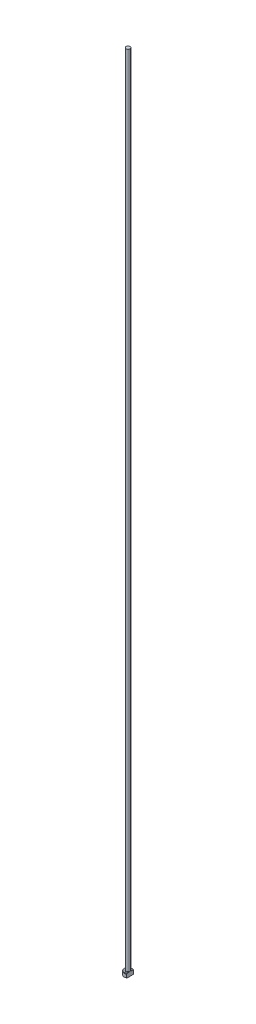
ISO-10303-21;
HEADER;
FILE_DESCRIPTION(('STEP AP214'),'2;1');
FILE_NAME('part.step','',(''),(''),'','','');
FILE_SCHEMA(('AUTOMOTIVE_DESIGN { 1 0 10303 214 1 1 1 1 }'));
ENDSEC;
DATA;
#1=APPLICATION_CONTEXT('core data for automotive mechanical design processes');
#2=APPLICATION_PROTOCOL_DEFINITION('international standard','automotive_design',2000,#1);
#3=PRODUCT_CONTEXT('',#1,'mechanical');
#4=PRODUCT('Part','Part','',(#3));
#5=PRODUCT_RELATED_PRODUCT_CATEGORY('part','',(#4));
#6=PRODUCT_DEFINITION_FORMATION('','',#4);
#7=PRODUCT_DEFINITION_CONTEXT('part definition',#1,'design');
#8=PRODUCT_DEFINITION('design','',#6,#7);
#9=PRODUCT_DEFINITION_SHAPE('','',#8);
#10=(LENGTH_UNIT() NAMED_UNIT(*) SI_UNIT(.MILLI.,.METRE.));
#11=(NAMED_UNIT(*) PLANE_ANGLE_UNIT() SI_UNIT($,.RADIAN.));
#12=(NAMED_UNIT(*) SI_UNIT($,.STERADIAN.) SOLID_ANGLE_UNIT());
#13=UNCERTAINTY_MEASURE_WITH_UNIT(LENGTH_MEASURE(1.E-05),#10,'distance_accuracy_value','');
#14=(GEOMETRIC_REPRESENTATION_CONTEXT(3) GLOBAL_UNCERTAINTY_ASSIGNED_CONTEXT((#13)) GLOBAL_UNIT_ASSIGNED_CONTEXT((#10,
#11,#12)) REPRESENTATION_CONTEXT('',''));
#15=CARTESIAN_POINT('',(0.,0.,0.));
#16=DIRECTION('',(0.,0.,1.));
#17=DIRECTION('',(1.,0.,0.));
#18=AXIS2_PLACEMENT_3D('',#15,#16,#17);
#19=CARTESIAN_POINT('',(0.,0.,0.));
#20=DIRECTION('',(0.,-1.,0.));
#21=DIRECTION('',(0.,0.,-1.));
#22=AXIS2_PLACEMENT_3D('',#19,#20,#21);
#23=PLANE('',#22);
#24=CARTESIAN_POINT('',(0.,0.,0.));
#25=DIRECTION('',(0.,-1.,0.));
#26=DIRECTION('',(0.,0.,-1.));
#27=AXIS2_PLACEMENT_3D('',#24,#25,#26);
#28=CIRCLE('',#27,1.80000000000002);
#29=CARTESIAN_POINT('',(0.999999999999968,0.,1.49666295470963));
#30=VERTEX_POINT('',#29);
#31=CARTESIAN_POINT('',(0.999999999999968,0.,-1.49666295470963));
#32=VERTEX_POINT('',#31);
#33=EDGE_CURVE('E98',#30,#32,#28,.T.);
#34=ORIENTED_EDGE('',*,*,#33,.T.);
#35=DIRECTION('',(0.,0.,1.));
#36=VECTOR('',#35,1.);
#37=CARTESIAN_POINT('',(0.999999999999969,0.,-1.73205080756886));
#38=LINE('',#37,#36);
#39=EDGE_CURVE('E83',#32,#30,#38,.T.);
#40=ORIENTED_EDGE('',*,*,#39,.T.);
#41=EDGE_LOOP('',(#34,#40));
#42=FACE_BOUND('',#41,.T.);
#43=ADVANCED_FACE('F32',(#42),#23,.T.);
#44=CARTESIAN_POINT('',(0.,259.958771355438,0.));
#45=DIRECTION('',(0.,1.,0.));
#46=DIRECTION('',(0.,0.,1.));
#47=AXIS2_PLACEMENT_3D('',#44,#45,#46);
#48=CYLINDRICAL_SURFACE('',#47,1.99999999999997);
#49=CARTESIAN_POINT('',(0.,1.79999999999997,0.));
#50=DIRECTION('',(0.,1.,0.));
#51=DIRECTION('',(0.,0.,1.));
#52=AXIS2_PLACEMENT_3D('',#49,#50,#51);
#53=CIRCLE('',#52,1.99999999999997);
#54=CARTESIAN_POINT('',(0.999999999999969,1.79999999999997,1.73205080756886));
#55=VERTEX_POINT('',#54);
#56=CARTESIAN_POINT('',(0.999999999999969,1.79999999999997,-1.73205080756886));
#57=VERTEX_POINT('',#56);
#58=EDGE_CURVE('E104',#55,#57,#53,.F.);
#59=ORIENTED_EDGE('',*,*,#58,.T.);
#60=DIRECTION('',(0.,-1.,0.));
#61=VECTOR('',#60,1.);
#62=CARTESIAN_POINT('',(0.999999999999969,400.,-1.73205080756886));
#63=LINE('',#62,#61);
#64=CARTESIAN_POINT('',(0.999999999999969,0.199999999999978,-1.73205080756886));
#65=VERTEX_POINT('',#64);
#66=EDGE_CURVE('E183',#57,#65,#63,.T.);
#67=ORIENTED_EDGE('',*,*,#66,.T.);
#68=CARTESIAN_POINT('',(0.,0.199999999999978,0.));
#69=DIRECTION('',(0.,-1.,0.));
#70=DIRECTION('',(0.,0.,-1.));
#71=AXIS2_PLACEMENT_3D('',#68,#69,#70);
#72=CIRCLE('',#71,1.99999999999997);
#73=CARTESIAN_POINT('',(0.999999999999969,0.199999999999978,1.73205080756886));
#74=VERTEX_POINT('',#73);
#75=EDGE_CURVE('E100',#65,#74,#72,.F.);
#76=ORIENTED_EDGE('',*,*,#75,.T.);
#77=DIRECTION('',(0.,-1.,0.));
#78=VECTOR('',#77,1.);
#79=CARTESIAN_POINT('',(0.999999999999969,400.,1.73205080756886));
#80=LINE('',#79,#78);
#81=EDGE_CURVE('E93',#55,#74,#80,.T.);
#82=ORIENTED_EDGE('',*,*,#81,.F.);
#83=EDGE_LOOP('',(#59,#67,#76,#82));
#84=FACE_BOUND('',#83,.T.);
#85=ADVANCED_FACE('F158',(#84),#48,.T.);
#86=CARTESIAN_POINT('',(-1.99999999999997,2.,0.));
#87=DIRECTION('',(0.,1.,0.));
#88=DIRECTION('',(0.,0.,1.));
#89=AXIS2_PLACEMENT_3D('',#86,#87,#88);
#90=PLANE('',#89);
#91=CARTESIAN_POINT('',(0.,2.,0.));
#92=DIRECTION('',(0.,1.,0.));
#93=DIRECTION('',(0.,0.,1.));
#94=AXIS2_PLACEMENT_3D('',#91,#92,#93);
#95=CIRCLE('',#94,1.79999999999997);
#96=CARTESIAN_POINT('',(0.999999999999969,2.,-1.49666295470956));
#97=VERTEX_POINT('',#96);
#98=CARTESIAN_POINT('',(0.999999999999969,2.,1.49666295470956));
#99=VERTEX_POINT('',#98);
#100=EDGE_CURVE('E178',#97,#99,#95,.T.);
#101=ORIENTED_EDGE('',*,*,#100,.T.);
#102=DIRECTION('',(0.,0.,-1.));
#103=VECTOR('',#102,1.);
#104=CARTESIAN_POINT('',(0.999999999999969,2.,0.));
#105=LINE('',#104,#103);
#106=CARTESIAN_POINT('',(0.999999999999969,1.99999999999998,0.66332495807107));
#107=VERTEX_POINT('',#106);
#108=EDGE_CURVE('E57',#99,#107,#105,.T.);
#109=ORIENTED_EDGE('',*,*,#108,.T.);
#110=CARTESIAN_POINT('',(0.,2.,0.));
#111=DIRECTION('',(0.,1.,0.));
#112=DIRECTION('',(0.,0.,1.));
#113=AXIS2_PLACEMENT_3D('',#110,#111,#112);
#114=CIRCLE('',#113,1.19999999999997);
#115=CARTESIAN_POINT('',(0.999999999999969,1.99999999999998,-0.663324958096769));
#116=VERTEX_POINT('',#115);
#117=EDGE_CURVE('E107',#107,#116,#114,.F.);
#118=ORIENTED_EDGE('',*,*,#117,.T.);
#119=EDGE_CURVE('E136',#116,#97,#105,.T.);
#120=ORIENTED_EDGE('',*,*,#119,.T.);
#121=EDGE_LOOP('',(#101,#109,#118,#120));
#122=FACE_BOUND('',#121,.T.);
#123=ADVANCED_FACE('F147',(#122),#90,.T.);
#124=CARTESIAN_POINT('',(0.,2.,0.));
#125=DIRECTION('',(0.,-1.,0.));
#126=DIRECTION('',(0.,0.,-1.));
#127=AXIS2_PLACEMENT_3D('',#124,#125,#126);
#128=CONICAL_SURFACE('',#127,1.79999999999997,0.785398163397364);
#129=ORIENTED_EDGE('',*,*,#58,.F.);
#130=CARTESIAN_POINT('',(0.999999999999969,-0.143084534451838,3.81417299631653));
#131=CARTESIAN_POINT('',(0.999999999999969,-0.0593997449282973,3.72765647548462));
#132=CARTESIAN_POINT('',(0.999999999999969,0.0241940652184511,3.64105173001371));
#133=CARTESIAN_POINT('',(0.999999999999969,0.191148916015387,3.46761616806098));
#134=CARTESIAN_POINT('',(0.999999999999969,0.274509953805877,3.38078534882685));
#135=CARTESIAN_POINT('',(0.999999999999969,0.524249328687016,3.11979400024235));
#136=CARTESIAN_POINT('',(0.999999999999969,0.690198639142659,2.94522254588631));
#137=CARTESIAN_POINT('',(0.999999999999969,1.01697550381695,2.59782670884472));
#138=CARTESIAN_POINT('',(0.999999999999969,1.17783928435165,2.42503661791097));
#139=CARTESIAN_POINT('',(0.999999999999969,1.41669118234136,2.16364984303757));
#140=CARTESIAN_POINT('',(0.999999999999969,1.49589273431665,2.07616357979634));
#141=CARTESIAN_POINT('',(0.999999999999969,1.65313803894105,1.90015721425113));
#142=CARTESIAN_POINT('',(0.999999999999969,1.73118183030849,1.81163714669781));
#143=CARTESIAN_POINT('',(0.999999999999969,1.85567318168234,1.66767927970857));
#144=CARTESIAN_POINT('',(0.999999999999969,1.90265415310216,1.61270332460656));
#145=CARTESIAN_POINT('',(0.999999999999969,1.99577882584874,1.50203557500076));
#146=CARTESIAN_POINT('',(0.999999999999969,2.04192244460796,1.44634371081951));
#147=CARTESIAN_POINT('',(0.999999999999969,2.13356596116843,1.33345480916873));
#148=CARTESIAN_POINT('',(0.999999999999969,2.17905399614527,1.27624810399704));
#149=CARTESIAN_POINT('',(0.999999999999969,2.26844283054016,1.1606097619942));
#150=CARTESIAN_POINT('',(0.999999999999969,2.31234379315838,1.1021782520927));
#151=CARTESIAN_POINT('',(0.999999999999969,2.39853453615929,0.982773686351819));
#152=CARTESIAN_POINT('',(0.999999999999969,2.44078986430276,0.921775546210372));
#153=CARTESIAN_POINT('',(0.999999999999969,2.52187810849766,0.797387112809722));
#154=CARTESIAN_POINT('',(0.999999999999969,2.56070631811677,0.733993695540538));
#155=CARTESIAN_POINT('',(0.999999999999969,2.63248592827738,0.604932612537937));
#156=CARTESIAN_POINT('',(0.999999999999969,2.66550424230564,0.539302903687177));
#157=CARTESIAN_POINT('',(0.999999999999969,2.72301550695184,0.404437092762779));
#158=CARTESIAN_POINT('',(0.999999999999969,2.74753707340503,0.335214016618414));
#159=CARTESIAN_POINT('',(0.999999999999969,2.77407110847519,0.23140094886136));
#160=CARTESIAN_POINT('',(0.999999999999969,2.7811074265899,0.198093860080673));
#161=CARTESIAN_POINT('',(0.999999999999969,2.7920050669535,0.130954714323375));
#162=CARTESIAN_POINT('',(0.999999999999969,2.79586666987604,0.0971227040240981));
#163=CARTESIAN_POINT('',(0.999999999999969,2.80013905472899,0.0293410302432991));
#164=CARTESIAN_POINT('',(0.999999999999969,2.8005604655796,-0.00460794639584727));
#165=CARTESIAN_POINT('',(0.999999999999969,2.79795882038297,-0.0723663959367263));
#166=CARTESIAN_POINT('',(0.999999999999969,2.79493547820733,-0.106175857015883));
#167=CARTESIAN_POINT('',(0.999999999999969,2.78105481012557,-0.206326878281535));
#168=CARTESIAN_POINT('',(0.999999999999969,2.76542146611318,-0.272037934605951));
#169=CARTESIAN_POINT('',(0.999999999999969,2.73477554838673,-0.368312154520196));
#170=CARTESIAN_POINT('',(0.999999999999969,2.7233106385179,-0.400123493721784));
#171=CARTESIAN_POINT('',(0.999999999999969,2.69840546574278,-0.462964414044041));
#172=CARTESIAN_POINT('',(0.999999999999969,2.68496560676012,-0.493994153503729));
#173=CARTESIAN_POINT('',(0.999999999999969,2.64209309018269,-0.586298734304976));
#174=CARTESIAN_POINT('',(0.999999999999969,2.61022871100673,-0.646435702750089));
#175=CARTESIAN_POINT('',(0.999999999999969,2.54228534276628,-0.764304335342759));
#176=CARTESIAN_POINT('',(0.999999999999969,2.50620119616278,-0.822032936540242));
#177=CARTESIAN_POINT('',(0.999999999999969,2.4310708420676,-0.935840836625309));
#178=CARTESIAN_POINT('',(0.999999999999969,2.39201347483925,-0.991912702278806));
#179=CARTESIAN_POINT('',(0.999999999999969,2.31195870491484,-1.1025984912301));
#180=CARTESIAN_POINT('',(0.999999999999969,2.27096226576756,-1.15721311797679));
#181=CARTESIAN_POINT('',(0.999999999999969,2.1870169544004,-1.26606869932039));
#182=CARTESIAN_POINT('',(0.999999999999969,2.14404946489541,-1.32029522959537));
#183=CARTESIAN_POINT('',(0.999999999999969,2.05705050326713,-1.42788988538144));
#184=CARTESIAN_POINT('',(0.999999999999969,2.01301896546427,-1.48125795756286));
#185=CARTESIAN_POINT('',(0.999999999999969,1.87995068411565,-1.64010952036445));
#186=CARTESIAN_POINT('',(0.999999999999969,1.78973357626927,-1.74460261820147));
#187=CARTESIAN_POINT('',(0.999999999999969,1.6229034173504,-1.9342683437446));
#188=CARTESIAN_POINT('',(0.999999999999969,1.54658658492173,-2.01970404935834));
#189=CARTESIAN_POINT('',(0.999999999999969,1.39301250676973,-2.18973019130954));
#190=CARTESIAN_POINT('',(0.999999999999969,1.31575523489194,-2.27432060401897));
#191=CARTESIAN_POINT('',(0.999999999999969,1.08283440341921,-2.52732479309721));
#192=CARTESIAN_POINT('',(0.999999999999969,0.926165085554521,-2.69481086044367));
#193=CARTESIAN_POINT('',(0.999999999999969,0.617772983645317,-3.02147252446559));
#194=CARTESIAN_POINT('',(0.999999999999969,0.466111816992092,-3.18070657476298));
#195=CARTESIAN_POINT('',(0.999999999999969,0.238015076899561,-3.41880818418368));
#196=CARTESIAN_POINT('',(0.999999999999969,0.161924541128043,-3.49800657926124));
#197=CARTESIAN_POINT('',(0.999999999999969,0.00955322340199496,-3.65621892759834));
#198=CARTESIAN_POINT('',(0.999999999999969,-0.0667275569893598,-3.7352328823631));
#199=CARTESIAN_POINT('',(0.999999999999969,-0.143084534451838,-3.81417299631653));
#200=B_SPLINE_CURVE_WITH_KNOTS('',3,(#130,#131,#132,#133,#134,#135,#136,#137,#138,#139,#140,
#141,#142,#143,#144,#145,#146,#147,#148,#149,#150,#151,#152,#153,#154,#155,#156,#157,#158,#159,
#160,#161,#162,#163,#164,#165,#166,#167,#168,#169,#170,#171,#172,#173,#174,#175,#176,#177,#178,
#179,#180,#181,#182,#183,#184,#185,#186,#187,#188,#189,#190,#191,#192,#193,#194,#195,#196,#197,
#198,#199),.UNSPECIFIED.,.F.,.F.,(4,2,2,2,2,2,2,2,2,2,2,2,2,2,2,2,2,2,2,2,2,2,2,2,2,2,2,2,2,2,2,
2,2,2,4),(0.,0.361101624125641,0.722207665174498,1.44478731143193,2.15299784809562,
2.50702638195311,2.86104304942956,3.07798416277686,3.29494655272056,3.51418925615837,
3.73340935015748,3.95594813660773,4.17878792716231,4.39886399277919,4.6181915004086,
4.72018864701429,4.82217677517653,4.92384967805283,5.0255310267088,5.22698459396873,
5.3283885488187,5.42977179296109,5.6336520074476,5.83778406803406,6.04272417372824,
6.24756349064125,6.45510395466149,6.66265726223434,7.07676259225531,7.42043039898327,
7.76410778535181,8.45210822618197,9.11180822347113,9.44129145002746,9.77077197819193),.UNSPECIFIED.);
#201=EDGE_CURVE('E135',#55,#99,#200,.T.);
#202=ORIENTED_EDGE('',*,*,#201,.T.);
#203=ORIENTED_EDGE('',*,*,#100,.F.);
#204=EDGE_CURVE('E127',#97,#57,#200,.T.);
#205=ORIENTED_EDGE('',*,*,#204,.T.);
#206=EDGE_LOOP('',(#129,#202,#203,#205));
#207=FACE_BOUND('',#206,.T.);
#208=ADVANCED_FACE('F143',(#207),#128,.T.);
#209=CARTESIAN_POINT('',(0.,0.199999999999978,0.));
#210=DIRECTION('',(0.,1.,0.));
#211=DIRECTION('',(0.,0.,1.));
#212=AXIS2_PLACEMENT_3D('',#209,#210,#211);
#213=CONICAL_SURFACE('',#212,1.99999999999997,0.785398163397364);
#214=ORIENTED_EDGE('',*,*,#75,.F.);
#215=CARTESIAN_POINT('',(0.999999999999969,2.14308453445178,-3.81417299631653));
#216=CARTESIAN_POINT('',(0.999999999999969,2.05939974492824,-3.72765647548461));
#217=CARTESIAN_POINT('',(0.999999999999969,1.97580593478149,-3.64105173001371));
#218=CARTESIAN_POINT('',(0.999999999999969,1.80885108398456,-3.46761616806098));
#219=CARTESIAN_POINT('',(0.999999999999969,1.72549004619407,-3.38078534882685));
#220=CARTESIAN_POINT('',(0.999999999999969,1.47575067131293,-3.11979400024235));
#221=CARTESIAN_POINT('',(0.999999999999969,1.30980136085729,-2.94522254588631));
#222=CARTESIAN_POINT('',(0.999999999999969,0.983024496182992,-2.59782670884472));
#223=CARTESIAN_POINT('',(0.999999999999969,0.822160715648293,-2.42503661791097));
#224=CARTESIAN_POINT('',(0.999999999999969,0.583308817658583,-2.16364984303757));
#225=CARTESIAN_POINT('',(0.999999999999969,0.504107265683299,-2.07616357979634));
#226=CARTESIAN_POINT('',(0.999999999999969,0.346861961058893,-1.90015721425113));
#227=CARTESIAN_POINT('',(0.999999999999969,0.26881816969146,-1.81163714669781));
#228=CARTESIAN_POINT('',(0.999999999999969,0.144326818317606,-1.66767927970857));
#229=CARTESIAN_POINT('',(0.999999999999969,0.0973458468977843,-1.61270332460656));
#230=CARTESIAN_POINT('',(0.999999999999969,0.00422117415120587,-1.50203557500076));
#231=CARTESIAN_POINT('',(0.999999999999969,-0.0419224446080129,-1.44634371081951));
#232=CARTESIAN_POINT('',(0.999999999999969,-0.133565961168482,-1.33345480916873));
#233=CARTESIAN_POINT('',(0.999999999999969,-0.179053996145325,-1.27624810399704));
#234=CARTESIAN_POINT('',(0.999999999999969,-0.268442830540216,-1.1606097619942));
#235=CARTESIAN_POINT('',(0.999999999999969,-0.312343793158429,-1.1021782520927));
#236=CARTESIAN_POINT('',(0.999999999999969,-0.398534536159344,-0.982773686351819));
#237=CARTESIAN_POINT('',(0.999999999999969,-0.440789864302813,-0.921775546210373));
#238=CARTESIAN_POINT('',(0.999999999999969,-0.52187810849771,-0.797387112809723));
#239=CARTESIAN_POINT('',(0.999999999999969,-0.560706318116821,-0.733993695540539));
#240=CARTESIAN_POINT('',(0.999999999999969,-0.632485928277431,-0.604932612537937));
#241=CARTESIAN_POINT('',(0.999999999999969,-0.665504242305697,-0.539302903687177));
#242=CARTESIAN_POINT('',(0.999999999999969,-0.723015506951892,-0.404437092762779));
#243=CARTESIAN_POINT('',(0.999999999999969,-0.747537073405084,-0.335214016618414));
#244=CARTESIAN_POINT('',(0.999999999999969,-0.774071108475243,-0.23140094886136));
#245=CARTESIAN_POINT('',(0.999999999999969,-0.781107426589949,-0.198093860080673));
#246=CARTESIAN_POINT('',(0.999999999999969,-0.792005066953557,-0.130954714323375));
#247=CARTESIAN_POINT('',(0.999999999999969,-0.795866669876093,-0.0971227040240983));
#248=CARTESIAN_POINT('',(0.999999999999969,-0.80013905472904,-0.0293410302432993));
#249=CARTESIAN_POINT('',(0.999999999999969,-0.800560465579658,0.00460794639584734));
#250=CARTESIAN_POINT('',(0.999999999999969,-0.797958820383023,0.0723663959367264));
#251=CARTESIAN_POINT('',(0.999999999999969,-0.794935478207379,0.106175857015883));
#252=CARTESIAN_POINT('',(0.999999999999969,-0.781054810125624,0.206326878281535));
#253=CARTESIAN_POINT('',(0.999999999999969,-0.765421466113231,0.272037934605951));
#254=CARTESIAN_POINT('',(0.999999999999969,-0.734775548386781,0.368312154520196));
#255=CARTESIAN_POINT('',(0.999999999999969,-0.723310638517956,0.400123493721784));
#256=CARTESIAN_POINT('',(0.999999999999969,-0.698405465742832,0.462964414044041));
#257=CARTESIAN_POINT('',(0.999999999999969,-0.684965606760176,0.493994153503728));
#258=CARTESIAN_POINT('',(0.999999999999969,-0.64209309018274,0.586298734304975));
#259=CARTESIAN_POINT('',(0.999999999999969,-0.610228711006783,0.646435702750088));
#260=CARTESIAN_POINT('',(0.999999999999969,-0.542285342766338,0.764304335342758));
#261=CARTESIAN_POINT('',(0.999999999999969,-0.506201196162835,0.822032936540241));
#262=CARTESIAN_POINT('',(0.999999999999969,-0.431070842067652,0.935840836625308));
#263=CARTESIAN_POINT('',(0.999999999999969,-0.3920134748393,0.991912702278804));
#264=CARTESIAN_POINT('',(0.999999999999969,-0.311958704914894,1.1025984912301));
#265=CARTESIAN_POINT('',(0.999999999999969,-0.270962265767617,1.15721311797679));
#266=CARTESIAN_POINT('',(0.999999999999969,-0.187016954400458,1.26606869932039));
#267=CARTESIAN_POINT('',(0.999999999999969,-0.144049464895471,1.32029522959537));
#268=CARTESIAN_POINT('',(0.999999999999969,-0.0570505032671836,1.42788988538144));
#269=CARTESIAN_POINT('',(0.999999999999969,-0.0130189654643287,1.48125795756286));
#270=CARTESIAN_POINT('',(0.999999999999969,0.12004931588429,1.64010952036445));
#271=CARTESIAN_POINT('',(0.999999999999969,0.210266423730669,1.74460261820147));
#272=CARTESIAN_POINT('',(0.999999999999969,0.377096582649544,1.93426834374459));
#273=CARTESIAN_POINT('',(0.999999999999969,0.453413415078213,2.01970404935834));
#274=CARTESIAN_POINT('',(0.999999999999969,0.606987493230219,2.18973019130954));
#275=CARTESIAN_POINT('',(0.999999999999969,0.684244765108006,2.27432060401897));
#276=CARTESIAN_POINT('',(0.999999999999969,0.917165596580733,2.52732479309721));
#277=CARTESIAN_POINT('',(0.999999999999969,1.07383491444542,2.69481086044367));
#278=CARTESIAN_POINT('',(0.999999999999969,1.38222701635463,3.02147252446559));
#279=CARTESIAN_POINT('',(0.999999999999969,1.53388818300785,3.18070657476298));
#280=CARTESIAN_POINT('',(0.999999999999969,1.76198492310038,3.41880818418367));
#281=CARTESIAN_POINT('',(0.999999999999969,1.8380754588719,3.49800657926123));
#282=CARTESIAN_POINT('',(0.999999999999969,1.99044677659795,3.65621892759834));
#283=CARTESIAN_POINT('',(0.999999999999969,2.0667275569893,3.7352328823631));
#284=CARTESIAN_POINT('',(0.999999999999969,2.14308453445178,3.81417299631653));
#285=B_SPLINE_CURVE_WITH_KNOTS('',3,(#215,#216,#217,#218,#219,#220,#221,#222,#223,#224,#225,
#226,#227,#228,#229,#230,#231,#232,#233,#234,#235,#236,#237,#238,#239,#240,#241,#242,#243,#244,
#245,#246,#247,#248,#249,#250,#251,#252,#253,#254,#255,#256,#257,#258,#259,#260,#261,#262,#263,
#264,#265,#266,#267,#268,#269,#270,#271,#272,#273,#274,#275,#276,#277,#278,#279,#280,#281,#282,
#283,#284),.UNSPECIFIED.,.F.,.F.,(4,2,2,2,2,2,2,2,2,2,2,2,2,2,2,2,2,2,2,2,2,2,2,2,2,2,2,2,2,2,2,
2,2,2,4),(0.,0.361101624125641,0.722207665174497,1.44478731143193,2.15299784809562,
2.50702638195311,2.86104304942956,3.07798416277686,3.29494655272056,3.51418925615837,
3.73340935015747,3.95594813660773,4.17878792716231,4.39886399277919,4.6181915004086,
4.72018864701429,4.82217677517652,4.92384967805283,5.0255310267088,5.22698459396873,
5.3283885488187,5.42977179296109,5.6336520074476,5.83778406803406,6.04272417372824,
6.24756349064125,6.45510395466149,6.66265726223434,7.07676259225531,7.42043039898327,
7.7641077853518,8.45210822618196,9.11180822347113,9.44129145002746,9.77077197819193),.UNSPECIFIED.);
#286=EDGE_CURVE('E86',#65,#32,#285,.T.);
#287=ORIENTED_EDGE('',*,*,#286,.T.);
#288=ORIENTED_EDGE('',*,*,#33,.F.);
#289=EDGE_CURVE('E89',#30,#74,#285,.T.);
#290=ORIENTED_EDGE('',*,*,#289,.T.);
#291=EDGE_LOOP('',(#214,#287,#288,#290));
#292=FACE_BOUND('',#291,.T.);
#293=ADVANCED_FACE('F97',(#292),#213,.T.);
#294=CARTESIAN_POINT('',(0.,2.19999999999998,0.));
#295=DIRECTION('',(0.,1.,0.));
#296=DIRECTION('',(0.,0.,1.));
#297=AXIS2_PLACEMENT_3D('',#294,#295,#296);
#298=TOROIDAL_SURFACE('',#297,1.19999999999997,0.2);
#299=CARTESIAN_POINT('',(0.999999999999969,2.19999999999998,0.));
#300=CARTESIAN_POINT('',(0.999999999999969,2.20000051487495,2.59081815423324E-12));
#301=CARTESIAN_POINT('',(0.999999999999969,2.20000102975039,-9.42496323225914E-08));
#302=CARTESIAN_POINT('',(0.999999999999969,2.20000202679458,-4.00799840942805E-07));
#303=CARTESIAN_POINT('',(0.999999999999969,2.20000250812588,-6.15372267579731E-07));
#304=CARTESIAN_POINT('',(0.999999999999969,2.20000346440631,-1.13351400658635E-06));
#305=CARTESIAN_POINT('',(0.999999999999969,2.20000393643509,-1.44235223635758E-06));
#306=CARTESIAN_POINT('',(0.999999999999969,2.20000483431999,-2.11388874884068E-06));
#307=CARTESIAN_POINT('',(0.999999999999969,2.20000526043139,-2.47625950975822E-06));
#308=CARTESIAN_POINT('',(0.999999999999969,2.20000666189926,-3.75794155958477E-06));
#309=CARTESIAN_POINT('',(0.999999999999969,2.20000757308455,-4.74818954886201E-06));
#310=CARTESIAN_POINT('',(0.999999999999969,2.2000092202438,-6.81289830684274E-06));
#311=CARTESIAN_POINT('',(0.999999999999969,2.20000996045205,-7.88417644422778E-06));
#312=CARTESIAN_POINT('',(0.999999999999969,2.20001267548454,-1.19907293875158E-05));
#313=CARTESIAN_POINT('',(0.999999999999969,2.20001450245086,-1.51274184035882E-05));
#314=CARTESIAN_POINT('',(0.999999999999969,2.20001755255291,-2.13715425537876E-05));
#315=CARTESIAN_POINT('',(0.999999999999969,2.20001881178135,-2.44620176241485E-05));
#316=CARTESIAN_POINT('',(0.999999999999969,2.20002404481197,-3.74145208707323E-05));
#317=CARTESIAN_POINT('',(0.999999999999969,2.20002793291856,-4.73052124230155E-05));
#318=CARTESIAN_POINT('',(0.999999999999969,2.20003428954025,-6.59457074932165E-05));
#319=CARTESIAN_POINT('',(0.999999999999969,2.20003688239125,-7.46515299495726E-05));
#320=CARTESIAN_POINT('',(0.999999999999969,2.20005709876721,-0.000137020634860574));
#321=CARTESIAN_POINT('',(0.999999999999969,2.20008244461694,-0.000187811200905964));
#322=CARTESIAN_POINT('',(0.999999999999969,2.2001767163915,-0.00038404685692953));
#323=CARTESIAN_POINT('',(0.999999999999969,2.20023990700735,-0.000531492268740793));
#324=CARTESIAN_POINT('',(0.999999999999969,2.20048701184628,-0.00109942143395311));
#325=CARTESIAN_POINT('',(0.999999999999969,2.20067693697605,-0.00151784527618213));
#326=CARTESIAN_POINT('',(0.999999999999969,2.20144296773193,-0.00321386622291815));
#327=CARTESIAN_POINT('',(0.999999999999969,2.20201230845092,-0.00449374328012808));
#328=CARTESIAN_POINT('',(0.999999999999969,2.20998444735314,-0.0224047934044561));
#329=CARTESIAN_POINT('',(0.999999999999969,2.21743524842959,-0.0390202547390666));
#330=CARTESIAN_POINT('',(0.999999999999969,2.23197002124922,-0.0717084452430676));
#331=CARTESIAN_POINT('',(0.999999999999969,2.23905766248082,-0.0877796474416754));
#332=CARTESIAN_POINT('',(0.999999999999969,2.25389009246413,-0.121781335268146));
#333=CARTESIAN_POINT('',(0.999999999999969,2.26161964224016,-0.139718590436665));
#334=CARTESIAN_POINT('',(0.999999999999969,2.27689168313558,-0.175878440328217));
#335=CARTESIAN_POINT('',(0.999999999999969,2.28443162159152,-0.194102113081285));
#336=CARTESIAN_POINT('',(0.999999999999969,2.30282726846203,-0.239840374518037));
#337=CARTESIAN_POINT('',(0.999999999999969,2.31345710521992,-0.267447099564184));
#338=CARTESIAN_POINT('',(0.999999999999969,2.33331094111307,-0.322481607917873));
#339=CARTESIAN_POINT('',(0.999999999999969,2.34256072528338,-0.349899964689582));
#340=CARTESIAN_POINT('',(0.999999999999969,2.35732089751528,-0.398044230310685));
#341=CARTESIAN_POINT('',(0.999999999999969,2.36317895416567,-0.41866173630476));
#342=CARTESIAN_POINT('',(0.999999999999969,2.37387907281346,-0.460275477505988));
#343=CARTESIAN_POINT('',(0.999999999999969,2.37871519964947,-0.481273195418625));
#344=CARTESIAN_POINT('',(0.999999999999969,2.39174175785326,-0.546853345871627));
#345=CARTESIAN_POINT('',(0.999999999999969,2.39776253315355,-0.591947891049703));
#346=CARTESIAN_POINT('',(0.999999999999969,2.40040174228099,-0.660990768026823));
#347=CARTESIAN_POINT('',(0.999999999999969,2.400126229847,-0.684818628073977));
#348=CARTESIAN_POINT('',(0.999999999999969,2.39660783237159,-0.732027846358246));
#349=CARTESIAN_POINT('',(0.999999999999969,2.39339826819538,-0.755411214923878));
#350=CARTESIAN_POINT('',(0.999999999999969,2.38447874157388,-0.796083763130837));
#351=CARTESIAN_POINT('',(0.999999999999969,2.37951676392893,-0.813533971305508));
#352=CARTESIAN_POINT('',(0.999999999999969,2.36698902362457,-0.847531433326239));
#353=CARTESIAN_POINT('',(0.999999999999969,2.35942232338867,-0.864078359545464));
#354=CARTESIAN_POINT('',(0.999999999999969,2.34431787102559,-0.890141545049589));
#355=CARTESIAN_POINT('',(0.999999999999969,2.33762931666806,-0.900148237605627));
#356=CARTESIAN_POINT('',(0.999999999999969,2.32281345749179,-0.9190336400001));
#357=CARTESIAN_POINT('',(0.999999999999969,2.3146887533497,-0.927914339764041));
#358=CARTESIAN_POINT('',(0.999999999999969,2.29878569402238,-0.942427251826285));
#359=CARTESIAN_POINT('',(0.999999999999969,2.29127620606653,-0.948352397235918));
#360=CARTESIAN_POINT('',(0.999999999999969,2.27538509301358,-0.958904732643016));
#361=CARTESIAN_POINT('',(0.999999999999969,2.26700378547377,-0.963532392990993));
#362=CARTESIAN_POINT('',(0.999999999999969,2.24944905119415,-0.971220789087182));
#363=CARTESIAN_POINT('',(0.999999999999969,2.24026913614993,-0.974266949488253));
#364=CARTESIAN_POINT('',(0.999999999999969,2.22148612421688,-0.978466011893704));
#365=CARTESIAN_POINT('',(0.999999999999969,2.21188346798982,-0.979620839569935));
#366=CARTESIAN_POINT('',(0.999999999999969,2.19406751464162,-0.979911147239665));
#367=CARTESIAN_POINT('',(0.999999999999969,2.18585759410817,-0.979318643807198));
#368=CARTESIAN_POINT('',(0.999999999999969,2.16966497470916,-0.976727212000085));
#369=CARTESIAN_POINT('',(0.999999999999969,2.16168225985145,-0.974728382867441));
#370=CARTESIAN_POINT('',(0.999999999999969,2.14632905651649,-0.969513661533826));
#371=CARTESIAN_POINT('',(0.999999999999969,2.13894889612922,-0.966325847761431));
#372=CARTESIAN_POINT('',(0.999999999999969,2.12474145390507,-0.958901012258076));
#373=CARTESIAN_POINT('',(0.999999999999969,2.11791436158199,-0.954663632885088));
#374=CARTESIAN_POINT('',(0.999999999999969,2.10210888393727,-0.94332347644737));
#375=CARTESIAN_POINT('',(0.999999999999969,2.09345388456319,-0.935769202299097));
#376=CARTESIAN_POINT('',(0.999999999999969,2.07747441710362,-0.919359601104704));
#377=CARTESIAN_POINT('',(0.999999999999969,2.07015330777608,-0.910501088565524));
#378=CARTESIAN_POINT('',(0.999999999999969,2.05394486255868,-0.887884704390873));
#379=CARTESIAN_POINT('',(0.999999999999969,2.04572469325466,-0.873650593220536));
#380=CARTESIAN_POINT('',(0.999999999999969,2.03162462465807,-0.844119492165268));
#381=CARTESIAN_POINT('',(0.999999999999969,2.02574383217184,-0.828822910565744));
#382=CARTESIAN_POINT('',(0.999999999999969,2.01314628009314,-0.788605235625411));
#383=CARTESIAN_POINT('',(0.999999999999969,2.00790637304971,-0.763225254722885));
#384=CARTESIAN_POINT('',(0.999999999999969,2.00123778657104,-0.711706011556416));
#385=CARTESIAN_POINT('',(0.999999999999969,1.99986086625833,-0.685561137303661));
#386=CARTESIAN_POINT('',(0.999999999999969,2.00029138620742,-0.610897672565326));
#387=CARTESIAN_POINT('',(0.999999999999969,2.00583944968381,-0.56240829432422));
#388=CARTESIAN_POINT('',(0.999999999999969,2.01894675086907,-0.492015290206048));
#389=CARTESIAN_POINT('',(0.999999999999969,2.02392178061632,-0.469516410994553));
#390=CARTESIAN_POINT('',(0.999999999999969,2.03507986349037,-0.424950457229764));
#391=CARTESIAN_POINT('',(0.999999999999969,2.04125559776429,-0.402881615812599));
#392=CARTESIAN_POINT('',(0.999999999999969,2.05640318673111,-0.35306390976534));
#393=CARTESIAN_POINT('',(0.999999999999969,2.06567810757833,-0.325409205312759));
#394=CARTESIAN_POINT('',(0.999999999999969,2.08561584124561,-0.26990072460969));
#395=CARTESIAN_POINT('',(0.999999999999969,2.09630536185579,-0.242056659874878));
#396=CARTESIAN_POINT('',(0.999999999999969,2.11482832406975,-0.195905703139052));
#397=CARTESIAN_POINT('',(0.999999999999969,2.12243033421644,-0.177504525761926));
#398=CARTESIAN_POINT('',(0.999999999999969,2.13783353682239,-0.140994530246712));
#399=CARTESIAN_POINT('',(0.999999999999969,2.14563210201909,-0.122884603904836));
#400=CARTESIAN_POINT('',(0.999999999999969,2.16059970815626,-0.0885577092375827));
#401=CARTESIAN_POINT('',(0.999999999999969,2.1677530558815,-0.0723337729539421));
#402=CARTESIAN_POINT('',(0.999999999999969,2.18242403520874,-0.0393353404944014));
#403=CARTESIAN_POINT('',(0.999999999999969,2.18994542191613,-0.0225624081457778));
#404=CARTESIAN_POINT('',(0.999999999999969,2.19798770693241,-0.00449370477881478));
#405=CARTESIAN_POINT('',(0.999999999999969,2.1985570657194,-0.00321379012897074));
#406=CARTESIAN_POINT('',(0.999999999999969,2.19932310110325,-0.00151776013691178));
#407=CARTESIAN_POINT('',(0.999999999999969,2.19951301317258,-0.00109936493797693));
#408=CARTESIAN_POINT('',(0.999999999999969,2.19976010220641,-0.000531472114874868));
#409=CARTESIAN_POINT('',(0.999999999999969,2.19982328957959,-0.000384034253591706));
#410=CARTESIAN_POINT('',(0.999999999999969,2.19991755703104,-0.000187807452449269));
#411=CARTESIAN_POINT('',(0.999999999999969,2.1999429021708,-0.000137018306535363));
#412=CARTESIAN_POINT('',(0.999999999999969,2.19996311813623,-7.46508462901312E-05));
#413=CARTESIAN_POINT('',(0.999999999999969,2.19996571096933,-6.59451379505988E-05));
#414=CARTESIAN_POINT('',(0.999999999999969,2.19997206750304,-4.73048898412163E-05));
#415=CARTESIAN_POINT('',(0.999999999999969,2.19997595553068,-3.74143280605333E-05));
#416=CARTESIAN_POINT('',(0.999999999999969,2.19998118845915,-2.44619706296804E-05));
#417=CARTESIAN_POINT('',(0.999999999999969,2.19998244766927,-2.1371514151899E-05));
#418=CARTESIAN_POINT('',(0.999999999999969,2.19998549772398,-1.5127424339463E-05));
#419=CARTESIAN_POINT('',(0.999999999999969,2.19998732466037,-1.19907504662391E-05));
#420=CARTESIAN_POINT('',(0.999999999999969,2.19999003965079,-7.88421136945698E-06));
#421=CARTESIAN_POINT('',(0.999999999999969,2.19999077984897,-6.81293469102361E-06));
#422=CARTESIAN_POINT('',(0.999999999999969,2.19999242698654,-4.74822681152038E-06));
#423=CARTESIAN_POINT('',(0.999999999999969,2.19999333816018,-3.75797816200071E-06));
#424=CARTESIAN_POINT('',(0.999999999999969,2.1999947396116,-2.47629275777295E-06));
#425=CARTESIAN_POINT('',(0.999999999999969,2.19999516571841,-2.1139205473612E-06));
#426=CARTESIAN_POINT('',(0.999999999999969,2.19999606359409,-1.44238031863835E-06));
#427=CARTESIAN_POINT('',(0.999999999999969,2.19999653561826,-1.13353981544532E-06));
#428=CARTESIAN_POINT('',(0.999999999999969,2.19999749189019,-6.15392568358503E-07));
#429=CARTESIAN_POINT('',(0.999999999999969,2.1999979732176,-4.00816998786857E-07));
#430=CARTESIAN_POINT('',(0.999999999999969,2.19999897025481,-9.42592106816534E-08));
#431=CARTESIAN_POINT('',(0.999999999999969,2.19999948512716,-2.59080736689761E-12));
#432=CARTESIAN_POINT('',(0.999999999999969,2.19999999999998,0.));
#433=B_SPLINE_CURVE_WITH_KNOTS('',3,(#299,#300,#301,#302,#303,#304,#305,#306,#307,#308,#309,
#310,#311,#312,#313,#314,#315,#316,#317,#318,#319,#320,#321,#322,#323,#324,#325,#326,#327,#328,
#329,#330,#331,#332,#333,#334,#335,#336,#337,#338,#339,#340,#341,#342,#343,#344,#345,#346,#347,
#348,#349,#350,#351,#352,#353,#354,#355,#356,#357,#358,#359,#360,#361,#362,#363,#364,#365,#366,
#367,#368,#369,#370,#371,#372,#373,#374,#375,#376,#377,#378,#379,#380,#381,#382,#383,#384,#385,
#386,#387,#388,#389,#390,#391,#392,#393,#394,#395,#396,#397,#398,#399,#400,#401,#402,#403,#404,
#405,#406,#407,#408,#409,#410,#411,#412,#413,#414,#415,#416,#417,#418,#419,#420,#421,#422,#423,
#424,#425,#426,#427,#428,#429,#430,#431,#432),.UNSPECIFIED.,.T.,.F.,(4,2,2,2,2,2,2,2,2,2,2,2,2,
2,2,2,2,2,2,2,2,2,2,2,2,2,2,2,2,2,2,2,2,2,2,2,2,2,2,2,2,2,2,2,2,2,2,2,2,2,2,2,2,2,2,2,2,2,2,2,2,
2,2,2,2,2,4),(0.,1.54318097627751E-06,3.11656716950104E-06,4.80252031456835E-06,
6.47855575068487E-06,1.04956563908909E-05,1.43988918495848E-05,2.52504396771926E-05,
3.52518428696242E-05,6.71249461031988E-05,9.43496753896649E-05,0.000263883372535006,
0.000745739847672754,0.00212351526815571,0.00632669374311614,0.0609485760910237,
0.113643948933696,0.172237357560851,0.231401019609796,0.320129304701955,0.406905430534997,
0.471177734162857,0.53581363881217,0.671617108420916,0.742973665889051,0.813529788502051,
0.867802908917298,0.922095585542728,0.958095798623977,0.994031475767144,1.02261929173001,
1.05119673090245,1.08003306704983,1.10884002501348,1.13341017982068,1.15797860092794,
1.18200020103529,1.20602999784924,1.24030227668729,1.27465969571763,1.32369575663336,
1.37271307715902,1.45002425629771,1.52836647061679,1.67385288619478,1.74297459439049,
1.81168748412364,1.89915940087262,1.9886152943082,2.04834216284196,2.10749314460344,
2.16068730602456,2.21582681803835,2.2200301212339,2.22140780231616,2.2218896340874,
2.22205916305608,2.22208638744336,2.22211826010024,2.22212826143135,2.22213911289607,
2.2221430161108,2.22214703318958,2.22214870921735,2.22215039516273,2.22215196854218,
2.22215351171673),.UNSPECIFIED.);
#434=CARTESIAN_POINT('',(0.999999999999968,2.19999999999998,0.));
#435=VERTEX_POINT('',#434);
#436=EDGE_CURVE('E11',#116,#435,#433,.T.);
#437=ORIENTED_EDGE('',*,*,#436,.F.);
#438=ORIENTED_EDGE('',*,*,#117,.F.);
#439=CARTESIAN_POINT('',(0.999999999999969,2.19999999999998,0.));
#440=CARTESIAN_POINT('',(0.999999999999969,2.19999948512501,-2.59088640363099E-12));
#441=CARTESIAN_POINT('',(0.999999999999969,2.19999897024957,9.42496322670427E-08));
#442=CARTESIAN_POINT('',(0.999999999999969,2.19999797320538,4.00799840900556E-07));
#443=CARTESIAN_POINT('',(0.999999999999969,2.19999749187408,6.15372267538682E-07));
#444=CARTESIAN_POINT('',(0.999999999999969,2.19999653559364,1.13351400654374E-06));
#445=CARTESIAN_POINT('',(0.999999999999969,2.19999606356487,1.44235223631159E-06));
#446=CARTESIAN_POINT('',(0.999999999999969,2.19999516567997,2.11388874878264E-06));
#447=CARTESIAN_POINT('',(0.999999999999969,2.19999473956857,2.47625950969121E-06));
#448=CARTESIAN_POINT('',(0.999999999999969,2.1999933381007,3.75794155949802E-06));
#449=CARTESIAN_POINT('',(0.999999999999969,2.19999242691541,4.74818954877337E-06));
#450=CARTESIAN_POINT('',(0.999999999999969,2.19999077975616,6.8128983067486E-06));
#451=CARTESIAN_POINT('',(0.999999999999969,2.19999003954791,7.88417644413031E-06));
#452=CARTESIAN_POINT('',(0.999999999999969,2.19998732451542,1.19907293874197E-05));
#453=CARTESIAN_POINT('',(0.999999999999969,2.1999854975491,1.51274184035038E-05));
#454=CARTESIAN_POINT('',(0.999999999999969,2.19998244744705,2.13715425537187E-05));
#455=CARTESIAN_POINT('',(0.999999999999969,2.19998118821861,2.44620176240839E-05));
#456=CARTESIAN_POINT('',(0.999999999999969,2.19997595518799,3.74145208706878E-05));
#457=CARTESIAN_POINT('',(0.999999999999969,2.1999720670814,4.73052124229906E-05));
#458=CARTESIAN_POINT('',(0.999999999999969,2.19996571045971,6.59457074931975E-05));
#459=CARTESIAN_POINT('',(0.999999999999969,2.19996311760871,7.46515299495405E-05));
#460=CARTESIAN_POINT('',(0.999999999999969,2.19994290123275,0.000137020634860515));
#461=CARTESIAN_POINT('',(0.999999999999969,2.19991755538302,0.000187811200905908));
#462=CARTESIAN_POINT('',(0.999999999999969,2.19982328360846,0.000384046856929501));
#463=CARTESIAN_POINT('',(0.999999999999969,2.19976009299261,0.000531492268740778));
#464=CARTESIAN_POINT('',(0.999999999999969,2.19951298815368,0.0010994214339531));
#465=CARTESIAN_POINT('',(0.999999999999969,2.19932306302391,0.00151784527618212));
#466=CARTESIAN_POINT('',(0.999999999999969,2.19855703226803,0.00321386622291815));
#467=CARTESIAN_POINT('',(0.999999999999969,2.19798769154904,0.00449374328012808));
#468=CARTESIAN_POINT('',(0.999999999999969,2.19001555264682,0.0224047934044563));
#469=CARTESIAN_POINT('',(0.999999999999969,2.18256475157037,0.0390202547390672));
#470=CARTESIAN_POINT('',(0.999999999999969,2.16802997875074,0.0717084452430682));
#471=CARTESIAN_POINT('',(0.999999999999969,2.16094233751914,0.0877796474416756));
#472=CARTESIAN_POINT('',(0.999999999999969,2.14610990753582,0.121781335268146));
#473=CARTESIAN_POINT('',(0.999999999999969,2.1383803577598,0.139718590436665));
#474=CARTESIAN_POINT('',(0.999999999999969,2.12310831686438,0.175878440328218));
#475=CARTESIAN_POINT('',(0.999999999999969,2.11556837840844,0.194102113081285));
#476=CARTESIAN_POINT('',(0.999999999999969,2.09717273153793,0.239840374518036));
#477=CARTESIAN_POINT('',(0.999999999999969,2.08654289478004,0.267447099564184));
#478=CARTESIAN_POINT('',(0.999999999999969,2.06668905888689,0.322481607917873));
#479=CARTESIAN_POINT('',(0.999999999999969,2.05743927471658,0.349899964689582));
#480=CARTESIAN_POINT('',(0.999999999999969,2.04267910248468,0.398044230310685));
#481=CARTESIAN_POINT('',(0.999999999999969,2.03682104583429,0.41866173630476));
#482=CARTESIAN_POINT('',(0.999999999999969,2.0261209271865,0.460275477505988));
#483=CARTESIAN_POINT('',(0.999999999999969,2.02128480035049,0.481273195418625));
#484=CARTESIAN_POINT('',(0.999999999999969,2.0082582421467,0.546853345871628));
#485=CARTESIAN_POINT('',(0.999999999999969,2.00223746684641,0.591947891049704));
#486=CARTESIAN_POINT('',(0.999999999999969,1.99959825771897,0.660990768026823));
#487=CARTESIAN_POINT('',(0.999999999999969,1.99987377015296,0.684818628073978));
#488=CARTESIAN_POINT('',(0.999999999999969,2.00339216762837,0.732027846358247));
#489=CARTESIAN_POINT('',(0.999999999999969,2.00660173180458,0.755411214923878));
#490=CARTESIAN_POINT('',(0.999999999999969,2.01552125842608,0.796083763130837));
#491=CARTESIAN_POINT('',(0.999999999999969,2.02048323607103,0.813533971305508));
#492=CARTESIAN_POINT('',(0.999999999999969,2.03301097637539,0.847531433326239));
#493=CARTESIAN_POINT('',(0.999999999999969,2.04057767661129,0.864078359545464));
#494=CARTESIAN_POINT('',(0.999999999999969,2.05568212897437,0.89014154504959));
#495=CARTESIAN_POINT('',(0.999999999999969,2.0623706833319,0.900148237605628));
#496=CARTESIAN_POINT('',(0.999999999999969,2.07718654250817,0.9190336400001));
#497=CARTESIAN_POINT('',(0.999999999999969,2.08531124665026,0.927914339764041));
#498=CARTESIAN_POINT('',(0.999999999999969,2.10121430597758,0.942427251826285));
#499=CARTESIAN_POINT('',(0.999999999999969,2.10872379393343,0.948352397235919));
#500=CARTESIAN_POINT('',(0.999999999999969,2.12461490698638,0.958904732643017));
#501=CARTESIAN_POINT('',(0.999999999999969,2.13299621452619,0.963532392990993));
#502=CARTESIAN_POINT('',(0.999999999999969,2.15055094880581,0.971220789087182));
#503=CARTESIAN_POINT('',(0.999999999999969,2.15973086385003,0.974266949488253));
#504=CARTESIAN_POINT('',(0.999999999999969,2.17851387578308,0.978466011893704));
#505=CARTESIAN_POINT('',(0.999999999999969,2.18811653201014,0.979620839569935));
#506=CARTESIAN_POINT('',(0.999999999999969,2.20593248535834,0.979911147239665));
#507=CARTESIAN_POINT('',(0.999999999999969,2.21414240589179,0.979318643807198));
#508=CARTESIAN_POINT('',(0.999999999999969,2.23033502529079,0.976727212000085));
#509=CARTESIAN_POINT('',(0.999999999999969,2.23831774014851,0.974728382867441));
#510=CARTESIAN_POINT('',(0.999999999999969,2.25367094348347,0.969513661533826));
#511=CARTESIAN_POINT('',(0.999999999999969,2.26105110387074,0.966325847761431));
#512=CARTESIAN_POINT('',(0.999999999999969,2.27525854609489,0.958901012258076));
#513=CARTESIAN_POINT('',(0.999999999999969,2.28208563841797,0.954663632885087));
#514=CARTESIAN_POINT('',(0.999999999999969,2.29789111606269,0.943323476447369));
#515=CARTESIAN_POINT('',(0.999999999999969,2.30654611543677,0.935769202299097));
#516=CARTESIAN_POINT('',(0.999999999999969,2.32252558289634,0.919359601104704));
#517=CARTESIAN_POINT('',(0.999999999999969,2.32984669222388,0.910501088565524));
#518=CARTESIAN_POINT('',(0.999999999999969,2.34605513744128,0.887884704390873));
#519=CARTESIAN_POINT('',(0.999999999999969,2.3542753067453,0.873650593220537));
#520=CARTESIAN_POINT('',(0.999999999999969,2.36837537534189,0.844119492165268));
#521=CARTESIAN_POINT('',(0.999999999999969,2.37425616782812,0.828822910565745));
#522=CARTESIAN_POINT('',(0.999999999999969,2.38685371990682,0.788605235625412));
#523=CARTESIAN_POINT('',(0.999999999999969,2.39209362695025,0.763225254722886));
#524=CARTESIAN_POINT('',(0.999999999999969,2.39876221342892,0.711706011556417));
#525=CARTESIAN_POINT('',(0.999999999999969,2.40013913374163,0.685561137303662));
#526=CARTESIAN_POINT('',(0.999999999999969,2.39970861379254,0.610897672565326));
#527=CARTESIAN_POINT('',(0.999999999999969,2.39416055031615,0.56240829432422));
#528=CARTESIAN_POINT('',(0.999999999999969,2.38105324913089,0.492015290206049));
#529=CARTESIAN_POINT('',(0.999999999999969,2.37607821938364,0.469516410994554));
#530=CARTESIAN_POINT('',(0.999999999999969,2.36492013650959,0.424950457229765));
#531=CARTESIAN_POINT('',(0.999999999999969,2.35874440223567,0.4028816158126));
#532=CARTESIAN_POINT('',(0.999999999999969,2.34359681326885,0.353063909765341));
#533=CARTESIAN_POINT('',(0.999999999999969,2.33432189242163,0.32540920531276));
#534=CARTESIAN_POINT('',(0.999999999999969,2.31438415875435,0.269900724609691));
#535=CARTESIAN_POINT('',(0.999999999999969,2.30369463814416,0.242056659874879));
#536=CARTESIAN_POINT('',(0.999999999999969,2.28517167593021,0.195905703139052));
#537=CARTESIAN_POINT('',(0.999999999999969,2.27756966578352,0.177504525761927));
#538=CARTESIAN_POINT('',(0.999999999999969,2.26216646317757,0.140994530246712));
#539=CARTESIAN_POINT('',(0.999999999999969,2.25436789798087,0.122884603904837));
#540=CARTESIAN_POINT('',(0.999999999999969,2.23940029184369,0.088557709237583));
#541=CARTESIAN_POINT('',(0.999999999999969,2.23224694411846,0.0723337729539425));
#542=CARTESIAN_POINT('',(0.999999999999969,2.21757596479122,0.0393353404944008));
#543=CARTESIAN_POINT('',(0.999999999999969,2.21005457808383,0.022562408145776));
#544=CARTESIAN_POINT('',(0.999999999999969,2.20201229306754,0.00449370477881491));
#545=CARTESIAN_POINT('',(0.999999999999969,2.20144293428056,0.00321379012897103));
#546=CARTESIAN_POINT('',(0.999999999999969,2.20067689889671,0.0015177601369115));
#547=CARTESIAN_POINT('',(0.999999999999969,2.20048698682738,0.00109936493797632));
#548=CARTESIAN_POINT('',(0.999999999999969,2.20023989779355,0.000531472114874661));
#549=CARTESIAN_POINT('',(0.999999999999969,2.20017671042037,0.000384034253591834));
#550=CARTESIAN_POINT('',(0.999999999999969,2.20008244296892,0.000187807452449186));
#551=CARTESIAN_POINT('',(0.999999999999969,2.20005709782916,0.000137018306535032));
#552=CARTESIAN_POINT('',(0.999999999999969,2.20003688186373,7.46508462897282E-05));
#553=CARTESIAN_POINT('',(0.999999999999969,2.20003428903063,6.59451379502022E-05));
#554=CARTESIAN_POINT('',(0.999999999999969,2.20002793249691,4.73048898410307E-05));
#555=CARTESIAN_POINT('',(0.999999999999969,2.20002404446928,3.74143280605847E-05));
#556=CARTESIAN_POINT('',(0.999999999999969,2.20001881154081,2.44619706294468E-05));
#557=CARTESIAN_POINT('',(0.999999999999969,2.20001755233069,2.13715141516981E-05));
#558=CARTESIAN_POINT('',(0.999999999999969,2.20001450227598,1.51274243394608E-05));
#559=CARTESIAN_POINT('',(0.999999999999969,2.20001267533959,1.19907504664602E-05));
#560=CARTESIAN_POINT('',(0.999999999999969,2.20000996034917,7.88421136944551E-06));
#561=CARTESIAN_POINT('',(0.999999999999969,2.20000922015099,6.8129346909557E-06));
#562=CARTESIAN_POINT('',(0.999999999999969,2.20000757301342,4.74822681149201E-06));
#563=CARTESIAN_POINT('',(0.999999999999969,2.20000666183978,3.75797816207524E-06));
#564=CARTESIAN_POINT('',(0.999999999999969,2.20000526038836,2.47629275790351E-06));
#565=CARTESIAN_POINT('',(0.999999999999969,2.20000483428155,2.11392054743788E-06));
#566=CARTESIAN_POINT('',(0.999999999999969,2.20000393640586,1.4423803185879E-06));
#567=CARTESIAN_POINT('',(0.999999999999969,2.2000034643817,1.13353981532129E-06));
#568=CARTESIAN_POINT('',(0.999999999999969,2.20000250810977,6.15392568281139E-07));
#569=CARTESIAN_POINT('',(0.999999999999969,2.20000202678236,4.00816998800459E-07));
#570=CARTESIAN_POINT('',(0.999999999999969,2.20000102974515,9.42592107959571E-08));
#571=CARTESIAN_POINT('',(0.999999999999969,2.2000005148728,2.59087561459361E-12));
#572=CARTESIAN_POINT('',(0.999999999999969,2.19999999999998,0.));
#573=B_SPLINE_CURVE_WITH_KNOTS('',3,(#439,#440,#441,#442,#443,#444,#445,#446,#447,#448,#449,
#450,#451,#452,#453,#454,#455,#456,#457,#458,#459,#460,#461,#462,#463,#464,#465,#466,#467,#468,
#469,#470,#471,#472,#473,#474,#475,#476,#477,#478,#479,#480,#481,#482,#483,#484,#485,#486,#487,
#488,#489,#490,#491,#492,#493,#494,#495,#496,#497,#498,#499,#500,#501,#502,#503,#504,#505,#506,
#507,#508,#509,#510,#511,#512,#513,#514,#515,#516,#517,#518,#519,#520,#521,#522,#523,#524,#525,
#526,#527,#528,#529,#530,#531,#532,#533,#534,#535,#536,#537,#538,#539,#540,#541,#542,#543,#544,
#545,#546,#547,#548,#549,#550,#551,#552,#553,#554,#555,#556,#557,#558,#559,#560,#561,#562,#563,
#564,#565,#566,#567,#568,#569,#570,#571,#572),.UNSPECIFIED.,.T.,.F.,(4,2,2,2,2,2,2,2,2,2,2,2,2,
2,2,2,2,2,2,2,2,2,2,2,2,2,2,2,2,2,2,2,2,2,2,2,2,2,2,2,2,2,2,2,2,2,2,2,2,2,2,2,2,2,2,2,2,2,2,2,2,
2,2,2,2,2,4),(0.,1.54318097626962E-06,3.11656716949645E-06,4.80252031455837E-06,
6.47855575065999E-06,1.04956563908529E-05,1.43988918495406E-05,2.52504396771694E-05,
3.52518428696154E-05,6.71249461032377E-05,9.43496753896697E-05,0.000263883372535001,
0.0007457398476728,0.00212351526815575,0.00632669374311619,0.0609485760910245,0.113643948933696,
0.172237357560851,0.231401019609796,0.320129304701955,0.406905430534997,0.471177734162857,
0.53581363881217,0.671617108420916,0.742973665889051,0.813529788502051,0.867802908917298,
0.922095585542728,0.958095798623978,0.994031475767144,1.02261929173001,1.05119673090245,
1.08003306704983,1.10884002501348,1.13341017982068,1.15797860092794,1.18200020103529,
1.20602999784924,1.2403022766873,1.27465969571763,1.32369575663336,1.37271307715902,
1.45002425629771,1.52836647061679,1.67385288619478,1.74297459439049,1.81168748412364,
1.89915940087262,1.9886152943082,2.04834216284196,2.10749314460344,2.16068730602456,
2.21582681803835,2.2200301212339,2.22140780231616,2.2218896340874,2.22205916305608,
2.22208638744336,2.22211826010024,2.22212826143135,2.22213911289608,2.22214301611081,
2.22214703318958,2.22214870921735,2.22215039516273,2.22215196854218,2.22215351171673),.UNSPECIFIED.);
#574=EDGE_CURVE('E46',#435,#107,#573,.T.);
#575=ORIENTED_EDGE('',*,*,#574,.F.);
#576=CARTESIAN_POINT('',(0.,2.19999999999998,0.));
#577=DIRECTION('',(0.,1.,0.));
#578=DIRECTION('',(0.,0.,1.));
#579=AXIS2_PLACEMENT_3D('',#576,#577,#578);
#580=CIRCLE('',#579,0.999999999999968);
#581=EDGE_CURVE('E103',#435,#435,#580,.T.);
#582=ORIENTED_EDGE('',*,*,#581,.F.);
#583=EDGE_LOOP('',(#437,#438,#575,#582));
#584=FACE_BOUND('',#583,.T.);
#585=ADVANCED_FACE('F34',(#584),#298,.F.);
#586=CARTESIAN_POINT('',(0.,259.958771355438,0.));
#587=DIRECTION('',(0.,1.,0.));
#588=DIRECTION('',(0.,0.,1.));
#589=AXIS2_PLACEMENT_3D('',#586,#587,#588);
#590=CYLINDRICAL_SURFACE('',#589,0.999999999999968);
#591=ORIENTED_EDGE('',*,*,#581,.T.);
#592=EDGE_LOOP('',(#591));
#593=FACE_BOUND('',#592,.T.);
#594=CARTESIAN_POINT('',(0.,400.,0.));
#595=DIRECTION('',(0.,1.,0.));
#596=DIRECTION('',(0.,0.,1.));
#597=AXIS2_PLACEMENT_3D('',#594,#595,#596);
#598=CIRCLE('',#597,0.999999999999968);
#599=CARTESIAN_POINT('',(0.,400.,0.999999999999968));
#600=VERTEX_POINT('',#599);
#601=EDGE_CURVE('E101',#600,#600,#598,.T.);
#602=ORIENTED_EDGE('',*,*,#601,.F.);
#603=EDGE_LOOP('',(#602));
#604=FACE_BOUND('',#603,.T.);
#605=ADVANCED_FACE('F155',(#593,#604),#590,.T.);
#606=CARTESIAN_POINT('',(-0.999999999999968,400.,0.));
#607=DIRECTION('',(0.,1.,0.));
#608=DIRECTION('',(0.,0.,1.));
#609=AXIS2_PLACEMENT_3D('',#606,#607,#608);
#610=PLANE('',#609);
#611=ORIENTED_EDGE('',*,*,#601,.T.);
#612=EDGE_LOOP('',(#611));
#613=FACE_BOUND('',#612,.T.);
#614=ADVANCED_FACE('F121',(#613),#610,.T.);
#615=CARTESIAN_POINT('',(0.999999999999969,400.,-1.73205080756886));
#616=DIRECTION('',(1.,0.,0.));
#617=DIRECTION('',(0.,0.,-1.));
#618=AXIS2_PLACEMENT_3D('',#615,#616,#617);
#619=PLANE('',#618);
#620=ORIENTED_EDGE('',*,*,#66,.F.);
#621=ORIENTED_EDGE('',*,*,#204,.F.);
#622=ORIENTED_EDGE('',*,*,#119,.F.);
#623=ORIENTED_EDGE('',*,*,#436,.T.);
#624=ORIENTED_EDGE('',*,*,#574,.T.);
#625=ORIENTED_EDGE('',*,*,#108,.F.);
#626=ORIENTED_EDGE('',*,*,#201,.F.);
#627=ORIENTED_EDGE('',*,*,#81,.T.);
#628=ORIENTED_EDGE('',*,*,#289,.F.);
#629=ORIENTED_EDGE('',*,*,#39,.F.);
#630=ORIENTED_EDGE('',*,*,#286,.F.);
#631=EDGE_LOOP('',(#620,#621,#622,#623,#624,#625,#626,#627,#628,#629,#630));
#632=FACE_BOUND('',#631,.T.);
#633=ADVANCED_FACE('F85',(#632),#619,.T.);
#634=CLOSED_SHELL('',(#43,#85,#123,#208,#293,#585,#605,#614,#633));
#635=MANIFOLD_SOLID_BREP('B2',#634);
#636=ADVANCED_BREP_SHAPE_REPRESENTATION('',(#18,#635),#14);
#637=SHAPE_DEFINITION_REPRESENTATION(#9,#636);
ENDSEC;
END-ISO-10303-21;
